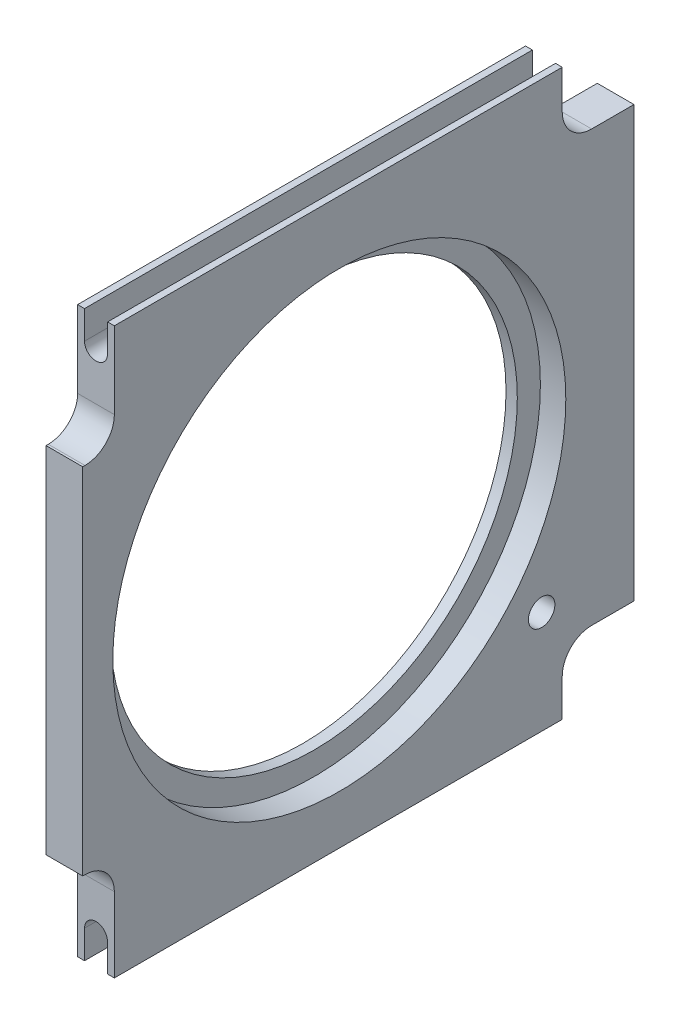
ISO-10303-21;
HEADER;
FILE_DESCRIPTION(('STEP AP214'),'2;1');
FILE_NAME('part.step','',(''),(''),'','','');
FILE_SCHEMA(('AUTOMOTIVE_DESIGN { 1 0 10303 214 1 1 1 1 }'));
ENDSEC;
DATA;
#1=APPLICATION_CONTEXT('core data for automotive mechanical design processes');
#2=APPLICATION_PROTOCOL_DEFINITION('international standard','automotive_design',2000,#1);
#3=PRODUCT_CONTEXT('',#1,'mechanical');
#4=PRODUCT('Part','Part','',(#3));
#5=PRODUCT_RELATED_PRODUCT_CATEGORY('part','',(#4));
#6=PRODUCT_DEFINITION_FORMATION('','',#4);
#7=PRODUCT_DEFINITION_CONTEXT('part definition',#1,'design');
#8=PRODUCT_DEFINITION('design','',#6,#7);
#9=PRODUCT_DEFINITION_SHAPE('','',#8);
#10=(LENGTH_UNIT() NAMED_UNIT(*) SI_UNIT(.MILLI.,.METRE.));
#11=(NAMED_UNIT(*) PLANE_ANGLE_UNIT() SI_UNIT($,.RADIAN.));
#12=(NAMED_UNIT(*) SI_UNIT($,.STERADIAN.) SOLID_ANGLE_UNIT());
#13=UNCERTAINTY_MEASURE_WITH_UNIT(LENGTH_MEASURE(1.E-05),#10,'distance_accuracy_value','');
#14=(GEOMETRIC_REPRESENTATION_CONTEXT(3) GLOBAL_UNCERTAINTY_ASSIGNED_CONTEXT((#13)) GLOBAL_UNIT_ASSIGNED_CONTEXT((#10,
#11,#12)) REPRESENTATION_CONTEXT('',''));
#15=CARTESIAN_POINT('',(0.,0.,0.));
#16=DIRECTION('',(0.,0.,1.));
#17=DIRECTION('',(1.,0.,0.));
#18=AXIS2_PLACEMENT_3D('',#15,#16,#17);
#19=CARTESIAN_POINT('',(8.255,-61.9477928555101,50.58201847));
#20=DIRECTION('',(0.,1.,0.));
#21=DIRECTION('',(0.,0.,1.));
#22=AXIS2_PLACEMENT_3D('',#19,#20,#21);
#23=PLANE('',#22);
#24=DIRECTION('',(0.,0.,-1.));
#25=VECTOR('',#24,1.);
#26=CARTESIAN_POINT('',(0.,-61.9477928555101,50.58201847));
#27=LINE('',#26,#25);
#28=CARTESIAN_POINT('',(0.,-61.9477928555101,50.58201847));
#29=VERTEX_POINT('',#28);
#30=CARTESIAN_POINT('',(0.,-61.9477928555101,-50.1230426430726));
#31=VERTEX_POINT('',#30);
#32=EDGE_CURVE('E364',#29,#31,#27,.T.);
#33=ORIENTED_EDGE('',*,*,#32,.T.);
#34=DIRECTION('',(1.,0.,0.));
#35=VECTOR('',#34,1.);
#36=CARTESIAN_POINT('',(8.255,-61.9477928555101,-50.1230426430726));
#37=LINE('',#36,#35);
#38=CARTESIAN_POINT('',(1.54781247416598,-61.9477928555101,-50.1230426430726));
#39=VERTEX_POINT('',#38);
#40=EDGE_CURVE('E248',#31,#39,#37,.T.);
#41=ORIENTED_EDGE('',*,*,#40,.T.);
#42=DIRECTION('',(0.,0.,1.));
#43=VECTOR('',#42,1.);
#44=CARTESIAN_POINT('',(1.54781247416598,-61.9477928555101,50.58201847));
#45=LINE('',#44,#43);
#46=CARTESIAN_POINT('',(1.54781247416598,-61.9477928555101,50.58201847));
#47=VERTEX_POINT('',#46);
#48=EDGE_CURVE('E297',#39,#47,#45,.T.);
#49=ORIENTED_EDGE('',*,*,#48,.T.);
#50=DIRECTION('',(-1.,0.,0.));
#51=VECTOR('',#50,1.);
#52=CARTESIAN_POINT('',(8.255,-61.9477928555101,50.58201847));
#53=LINE('',#52,#51);
#54=EDGE_CURVE('E387',#47,#29,#53,.T.);
#55=ORIENTED_EDGE('',*,*,#54,.T.);
#56=EDGE_LOOP('',(#33,#41,#49,#55));
#57=FACE_BOUND('',#56,.T.);
#58=ADVANCED_FACE('F32',(#57),#23,.F.);
#59=CARTESIAN_POINT('',(8.255,65.0522071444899,50.58201847));
#60=DIRECTION('',(0.,-1.,0.));
#61=DIRECTION('',(0.,0.,-1.));
#62=AXIS2_PLACEMENT_3D('',#59,#60,#61);
#63=PLANE('',#62);
#64=DIRECTION('',(0.,0.,1.));
#65=VECTOR('',#64,1.);
#66=CARTESIAN_POINT('',(8.255,65.0522071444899,50.58201847));
#67=LINE('',#66,#65);
#68=CARTESIAN_POINT('',(8.255,65.0522071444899,-50.1230426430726));
#69=VERTEX_POINT('',#68);
#70=CARTESIAN_POINT('',(8.255,65.0522071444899,50.58201847));
#71=VERTEX_POINT('',#70);
#72=EDGE_CURVE('E346',#69,#71,#67,.T.);
#73=ORIENTED_EDGE('',*,*,#72,.F.);
#74=DIRECTION('',(-1.,0.,0.));
#75=VECTOR('',#74,1.);
#76=CARTESIAN_POINT('',(8.255,65.0522071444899,-50.1230426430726));
#77=LINE('',#76,#75);
#78=CARTESIAN_POINT('',(6.74267838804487,65.0522071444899,-50.1230426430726));
#79=VERTEX_POINT('',#78);
#80=EDGE_CURVE('E282',#69,#79,#77,.T.);
#81=ORIENTED_EDGE('',*,*,#80,.T.);
#82=DIRECTION('',(0.,0.,1.));
#83=VECTOR('',#82,1.);
#84=CARTESIAN_POINT('',(6.74267838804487,65.0522071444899,50.58201847));
#85=LINE('',#84,#83);
#86=CARTESIAN_POINT('',(6.74267838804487,65.0522071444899,50.58201847));
#87=VERTEX_POINT('',#86);
#88=EDGE_CURVE('E314',#79,#87,#85,.T.);
#89=ORIENTED_EDGE('',*,*,#88,.T.);
#90=DIRECTION('',(-1.,0.,0.));
#91=VECTOR('',#90,1.);
#92=CARTESIAN_POINT('',(8.255,65.0522071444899,50.58201847));
#93=LINE('',#92,#91);
#94=EDGE_CURVE('E384',#71,#87,#93,.T.);
#95=ORIENTED_EDGE('',*,*,#94,.F.);
#96=EDGE_LOOP('',(#73,#81,#89,#95));
#97=FACE_BOUND('',#96,.T.);
#98=ADVANCED_FACE('F472',(#97),#63,.F.);
#99=CARTESIAN_POINT('',(8.255,0.,0.));
#100=DIRECTION('',(-1.,0.,0.));
#101=DIRECTION('',(0.,0.,1.));
#102=AXIS2_PLACEMENT_3D('',#99,#100,#101);
#103=CYLINDRICAL_SURFACE('',#102,45.7376354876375);
#104=CARTESIAN_POINT('',(0.,0.,0.));
#105=DIRECTION('',(1.,0.,0.));
#106=DIRECTION('',(0.,0.,-1.));
#107=AXIS2_PLACEMENT_3D('',#104,#105,#106);
#108=CIRCLE('',#107,45.7376354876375);
#109=CARTESIAN_POINT('',(0.,0.,-45.7376354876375));
#110=VERTEX_POINT('',#109);
#111=EDGE_CURVE('E323',#110,#110,#108,.T.);
#112=ORIENTED_EDGE('',*,*,#111,.F.);
#113=EDGE_LOOP('',(#112));
#114=FACE_BOUND('',#113,.T.);
#115=CARTESIAN_POINT('',(2.54,0.,0.));
#116=DIRECTION('',(1.,0.,0.));
#117=DIRECTION('',(0.,0.,-1.));
#118=AXIS2_PLACEMENT_3D('',#115,#116,#117);
#119=CIRCLE('',#118,45.7376354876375);
#120=CARTESIAN_POINT('',(2.54,0.,-45.7376354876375));
#121=VERTEX_POINT('',#120);
#122=EDGE_CURVE('E319',#121,#121,#119,.T.);
#123=ORIENTED_EDGE('',*,*,#122,.T.);
#124=EDGE_LOOP('',(#123));
#125=FACE_BOUND('',#124,.T.);
#126=ADVANCED_FACE('F479',(#114,#125),#103,.F.);
#127=CARTESIAN_POINT('',(8.255,-45.1325896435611,57.18601847));
#128=DIRECTION('',(-1.,0.,0.));
#129=DIRECTION('',(0.,0.,1.));
#130=AXIS2_PLACEMENT_3D('',#127,#128,#129);
#131=PLANE('',#130);
#132=CARTESIAN_POINT('',(8.255,0.,0.));
#133=DIRECTION('',(-1.,0.,0.));
#134=DIRECTION('',(0.,0.,1.));
#135=AXIS2_PLACEMENT_3D('',#132,#133,#134);
#136=CIRCLE('',#135,50.927);
#137=CARTESIAN_POINT('',(8.255,0.,50.927));
#138=VERTEX_POINT('',#137);
#139=EDGE_CURVE('E327',#138,#138,#136,.T.);
#140=ORIENTED_EDGE('',*,*,#139,.T.);
#141=EDGE_LOOP('',(#140));
#142=FACE_BOUND('',#141,.T.);
#143=DIRECTION('',(0.,0.,-1.));
#144=VECTOR('',#143,1.);
#145=CARTESIAN_POINT('',(8.255,-61.9477928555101,50.58201847));
#146=LINE('',#145,#144);
#147=CARTESIAN_POINT('',(8.255,-61.9477928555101,50.58201847));
#148=VERTEX_POINT('',#147);
#149=CARTESIAN_POINT('',(8.255,-61.9477928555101,-50.1230426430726));
#150=VERTEX_POINT('',#149);
#151=EDGE_CURVE('E341',#148,#150,#146,.T.);
#152=ORIENTED_EDGE('',*,*,#151,.T.);
#153=DIRECTION('',(0.,-1.,0.));
#154=VECTOR('',#153,1.);
#155=CARTESIAN_POINT('',(8.255,-53.5614383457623,-50.1230426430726));
#156=LINE('',#155,#154);
#157=CARTESIAN_POINT('',(8.255,-53.5614383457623,-50.1230426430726));
#158=VERTEX_POINT('',#157);
#159=EDGE_CURVE('E231',#158,#150,#156,.T.);
#160=ORIENTED_EDGE('',*,*,#159,.F.);
#161=CARTESIAN_POINT('',(8.255,-53.5614383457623,-56.7270426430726));
#162=DIRECTION('',(1.,0.,0.));
#163=DIRECTION('',(0.,0.,1.));
#164=AXIS2_PLACEMENT_3D('',#161,#162,#163);
#165=CIRCLE('',#164,6.604);
#166=CARTESIAN_POINT('',(8.255,-46.9574383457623,-56.7270426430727));
#167=VERTEX_POINT('',#166);
#168=EDGE_CURVE('E233',#167,#158,#165,.T.);
#169=ORIENTED_EDGE('',*,*,#168,.F.);
#170=DIRECTION('',(0.,0.,1.));
#171=VECTOR('',#170,1.);
#172=CARTESIAN_POINT('',(8.255,-46.9574383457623,-56.7270426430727));
#173=LINE('',#172,#171);
#174=CARTESIAN_POINT('',(8.255,-46.9574383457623,-66.25798153));
#175=VERTEX_POINT('',#174);
#176=EDGE_CURVE('E210',#175,#167,#173,.T.);
#177=ORIENTED_EDGE('',*,*,#176,.F.);
#178=DIRECTION('',(0.,1.,0.));
#179=VECTOR('',#178,1.);
#180=CARTESIAN_POINT('',(8.255,65.0522071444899,-66.25798153));
#181=LINE('',#180,#179);
#182=CARTESIAN_POINT('',(8.255,49.7211548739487,-66.25798153));
#183=VERTEX_POINT('',#182);
#184=EDGE_CURVE('E344',#175,#183,#181,.T.);
#185=ORIENTED_EDGE('',*,*,#184,.T.);
#186=DIRECTION('',(0.,0.,-1.));
#187=VECTOR('',#186,1.);
#188=CARTESIAN_POINT('',(8.255,49.7211548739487,-56.7270426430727));
#189=LINE('',#188,#187);
#190=CARTESIAN_POINT('',(8.255,49.7211548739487,-56.7270426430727));
#191=VERTEX_POINT('',#190);
#192=EDGE_CURVE('E256',#191,#183,#189,.T.);
#193=ORIENTED_EDGE('',*,*,#192,.F.);
#194=CARTESIAN_POINT('',(8.255,56.3251548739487,-56.7270426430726));
#195=DIRECTION('',(1.,0.,0.));
#196=DIRECTION('',(0.,0.,-1.));
#197=AXIS2_PLACEMENT_3D('',#194,#195,#196);
#198=CIRCLE('',#197,6.604);
#199=CARTESIAN_POINT('',(8.255,56.3251548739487,-50.1230426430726));
#200=VERTEX_POINT('',#199);
#201=EDGE_CURVE('E264',#200,#191,#198,.T.);
#202=ORIENTED_EDGE('',*,*,#201,.F.);
#203=DIRECTION('',(0.,-1.,0.));
#204=VECTOR('',#203,1.);
#205=CARTESIAN_POINT('',(8.255,71.5191522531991,-50.1230426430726));
#206=LINE('',#205,#204);
#207=EDGE_CURVE('E251',#69,#200,#206,.T.);
#208=ORIENTED_EDGE('',*,*,#207,.F.);
#209=ORIENTED_EDGE('',*,*,#72,.T.);
#210=DIRECTION('',(0.,-1.,0.));
#211=VECTOR('',#210,1.);
#212=CARTESIAN_POINT('',(8.255,65.0522071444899,50.58201847));
#213=LINE('',#212,#211);
#214=CARTESIAN_POINT('',(8.255,47.7611548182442,50.58201847));
#215=VERTEX_POINT('',#214);
#216=EDGE_CURVE('E348',#71,#215,#213,.T.);
#217=ORIENTED_EDGE('',*,*,#216,.T.);
#218=CARTESIAN_POINT('',(8.255,47.7611548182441,57.18601847));
#219=DIRECTION('',(-1.,0.,0.));
#220=DIRECTION('',(0.,0.,-1.));
#221=AXIS2_PLACEMENT_3D('',#218,#219,#220);
#222=CIRCLE('',#221,6.604);
#223=CARTESIAN_POINT('',(8.255,41.1571548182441,57.1860184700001));
#224=VERTEX_POINT('',#223);
#225=EDGE_CURVE('E350',#215,#224,#222,.T.);
#226=ORIENTED_EDGE('',*,*,#225,.T.);
#227=DIRECTION('',(0.,0.,1.));
#228=VECTOR('',#227,1.);
#229=CARTESIAN_POINT('',(8.255,41.1571548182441,57.1860184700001));
#230=LINE('',#229,#228);
#231=CARTESIAN_POINT('',(8.255,41.1571548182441,57.69401847));
#232=VERTEX_POINT('',#231);
#233=EDGE_CURVE('E352',#224,#232,#230,.T.);
#234=ORIENTED_EDGE('',*,*,#233,.T.);
#235=DIRECTION('',(0.,-1.,0.));
#236=VECTOR('',#235,1.);
#237=CARTESIAN_POINT('',(8.255,41.1571548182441,57.69401847));
#238=LINE('',#237,#236);
#239=CARTESIAN_POINT('',(8.255,-38.5285896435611,57.69401847));
#240=VERTEX_POINT('',#239);
#241=EDGE_CURVE('E331',#232,#240,#238,.T.);
#242=ORIENTED_EDGE('',*,*,#241,.T.);
#243=DIRECTION('',(0.,0.,-1.));
#244=VECTOR('',#243,1.);
#245=CARTESIAN_POINT('',(8.255,-38.5285896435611,57.69401847));
#246=LINE('',#245,#244);
#247=CARTESIAN_POINT('',(8.255,-38.5285896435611,57.18601847));
#248=VERTEX_POINT('',#247);
#249=EDGE_CURVE('E334',#240,#248,#246,.T.);
#250=ORIENTED_EDGE('',*,*,#249,.T.);
#251=CARTESIAN_POINT('',(8.255,-45.1325896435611,57.18601847));
#252=DIRECTION('',(-1.,0.,0.));
#253=DIRECTION('',(0.,0.,1.));
#254=AXIS2_PLACEMENT_3D('',#251,#252,#253);
#255=CIRCLE('',#254,6.60399999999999);
#256=CARTESIAN_POINT('',(8.255,-45.1325896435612,50.58201847));
#257=VERTEX_POINT('',#256);
#258=EDGE_CURVE('E337',#248,#257,#255,.T.);
#259=ORIENTED_EDGE('',*,*,#258,.T.);
#260=DIRECTION('',(0.,-1.,0.));
#261=VECTOR('',#260,1.);
#262=CARTESIAN_POINT('',(8.255,-45.1325896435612,50.58201847));
#263=LINE('',#262,#261);
#264=EDGE_CURVE('E339',#257,#148,#263,.T.);
#265=ORIENTED_EDGE('',*,*,#264,.T.);
#266=EDGE_LOOP('',(#152,#160,#169,#177,#185,#193,#202,#208,#209,#217,#226,#234,#242,#250,#259,#265));
#267=FACE_BOUND('',#266,.T.);
#268=CARTESIAN_POINT('',(8.255,-38.7619677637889,-45.4889270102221));
#269=DIRECTION('',(1.,0.,0.));
#270=DIRECTION('',(0.,0.,-1.));
#271=AXIS2_PLACEMENT_3D('',#268,#269,#270);
#272=CIRCLE('',#271,2.97643548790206);
#273=CARTESIAN_POINT('',(8.255,-38.7619677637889,-48.4653624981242));
#274=VERTEX_POINT('',#273);
#275=EDGE_CURVE('E320',#274,#274,#272,.T.);
#276=ORIENTED_EDGE('',*,*,#275,.F.);
#277=EDGE_LOOP('',(#276));
#278=FACE_BOUND('',#277,.T.);
#279=ADVANCED_FACE('F524',(#142,#267,#278),#131,.F.);
#280=CARTESIAN_POINT('',(0.,-45.1325896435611,57.18601847));
#281=DIRECTION('',(-1.,0.,0.));
#282=DIRECTION('',(0.,0.,1.));
#283=AXIS2_PLACEMENT_3D('',#280,#281,#282);
#284=PLANE('',#283);
#285=DIRECTION('',(0.,-1.,0.));
#286=VECTOR('',#285,1.);
#287=CARTESIAN_POINT('',(0.,-53.5614383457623,-50.1230426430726));
#288=LINE('',#287,#286);
#289=CARTESIAN_POINT('',(0.,-53.5614383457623,-50.1230426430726));
#290=VERTEX_POINT('',#289);
#291=EDGE_CURVE('E215',#290,#31,#288,.T.);
#292=ORIENTED_EDGE('',*,*,#291,.T.);
#293=ORIENTED_EDGE('',*,*,#32,.F.);
#294=DIRECTION('',(0.,-1.,0.));
#295=VECTOR('',#294,1.);
#296=CARTESIAN_POINT('',(0.,-45.1325896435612,50.58201847));
#297=LINE('',#296,#295);
#298=CARTESIAN_POINT('',(0.,-45.1325896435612,50.58201847));
#299=VERTEX_POINT('',#298);
#300=EDGE_CURVE('E361',#299,#29,#297,.T.);
#301=ORIENTED_EDGE('',*,*,#300,.F.);
#302=CARTESIAN_POINT('',(0.,-45.1325896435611,57.18601847));
#303=DIRECTION('',(-1.,0.,0.));
#304=DIRECTION('',(0.,0.,1.));
#305=AXIS2_PLACEMENT_3D('',#302,#303,#304);
#306=CIRCLE('',#305,6.60399999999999);
#307=CARTESIAN_POINT('',(0.,-38.5285896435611,57.18601847));
#308=VERTEX_POINT('',#307);
#309=EDGE_CURVE('E359',#308,#299,#306,.T.);
#310=ORIENTED_EDGE('',*,*,#309,.F.);
#311=DIRECTION('',(0.,0.,-1.));
#312=VECTOR('',#311,1.);
#313=CARTESIAN_POINT('',(0.,-38.5285896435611,57.69401847));
#314=LINE('',#313,#312);
#315=CARTESIAN_POINT('',(0.,-38.5285896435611,57.69401847));
#316=VERTEX_POINT('',#315);
#317=EDGE_CURVE('E357',#316,#308,#314,.T.);
#318=ORIENTED_EDGE('',*,*,#317,.F.);
#319=DIRECTION('',(0.,-1.,0.));
#320=VECTOR('',#319,1.);
#321=CARTESIAN_POINT('',(0.,41.1571548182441,57.69401847));
#322=LINE('',#321,#320);
#323=CARTESIAN_POINT('',(0.,41.1571548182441,57.69401847));
#324=VERTEX_POINT('',#323);
#325=EDGE_CURVE('E330',#324,#316,#322,.T.);
#326=ORIENTED_EDGE('',*,*,#325,.F.);
#327=DIRECTION('',(0.,0.,1.));
#328=VECTOR('',#327,1.);
#329=CARTESIAN_POINT('',(0.,41.1571548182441,57.1860184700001));
#330=LINE('',#329,#328);
#331=CARTESIAN_POINT('',(0.,41.1571548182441,57.1860184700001));
#332=VERTEX_POINT('',#331);
#333=EDGE_CURVE('E335',#332,#324,#330,.T.);
#334=ORIENTED_EDGE('',*,*,#333,.F.);
#335=CARTESIAN_POINT('',(0.,47.7611548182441,57.18601847));
#336=DIRECTION('',(-1.,0.,0.));
#337=DIRECTION('',(0.,0.,-1.));
#338=AXIS2_PLACEMENT_3D('',#335,#336,#337);
#339=CIRCLE('',#338,6.604);
#340=CARTESIAN_POINT('',(0.,47.7611548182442,50.58201847));
#341=VERTEX_POINT('',#340);
#342=EDGE_CURVE('E372',#341,#332,#339,.T.);
#343=ORIENTED_EDGE('',*,*,#342,.F.);
#344=DIRECTION('',(0.,-1.,0.));
#345=VECTOR('',#344,1.);
#346=CARTESIAN_POINT('',(0.,65.0522071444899,50.58201847));
#347=LINE('',#346,#345);
#348=CARTESIAN_POINT('',(0.,65.0522071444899,50.58201847));
#349=VERTEX_POINT('',#348);
#350=EDGE_CURVE('E370',#349,#341,#347,.T.);
#351=ORIENTED_EDGE('',*,*,#350,.F.);
#352=DIRECTION('',(0.,0.,1.));
#353=VECTOR('',#352,1.);
#354=CARTESIAN_POINT('',(0.,65.0522071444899,50.58201847));
#355=LINE('',#354,#353);
#356=CARTESIAN_POINT('',(0.,65.0522071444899,-50.1230426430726));
#357=VERTEX_POINT('',#356);
#358=EDGE_CURVE('E368',#357,#349,#355,.T.);
#359=ORIENTED_EDGE('',*,*,#358,.F.);
#360=DIRECTION('',(0.,-1.,0.));
#361=VECTOR('',#360,1.);
#362=CARTESIAN_POINT('',(0.,71.5191522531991,-50.1230426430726));
#363=LINE('',#362,#361);
#364=CARTESIAN_POINT('',(0.,56.3251548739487,-50.1230426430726));
#365=VERTEX_POINT('',#364);
#366=EDGE_CURVE('E252',#357,#365,#363,.T.);
#367=ORIENTED_EDGE('',*,*,#366,.T.);
#368=CARTESIAN_POINT('',(0.,56.3251548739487,-56.7270426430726));
#369=DIRECTION('',(1.,0.,0.));
#370=DIRECTION('',(0.,0.,-1.));
#371=AXIS2_PLACEMENT_3D('',#368,#369,#370);
#372=CIRCLE('',#371,6.604);
#373=CARTESIAN_POINT('',(0.,49.7211548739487,-56.7270426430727));
#374=VERTEX_POINT('',#373);
#375=EDGE_CURVE('E255',#365,#374,#372,.T.);
#376=ORIENTED_EDGE('',*,*,#375,.T.);
#377=DIRECTION('',(0.,0.,-1.));
#378=VECTOR('',#377,1.);
#379=CARTESIAN_POINT('',(0.,49.7211548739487,-56.7270426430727));
#380=LINE('',#379,#378);
#381=CARTESIAN_POINT('',(0.,49.7211548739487,-66.25798153));
#382=VERTEX_POINT('',#381);
#383=EDGE_CURVE('E259',#374,#382,#380,.T.);
#384=ORIENTED_EDGE('',*,*,#383,.T.);
#385=DIRECTION('',(0.,1.,0.));
#386=VECTOR('',#385,1.);
#387=CARTESIAN_POINT('',(0.,65.0522071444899,-66.25798153));
#388=LINE('',#387,#386);
#389=CARTESIAN_POINT('',(0.,-46.9574383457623,-66.25798153));
#390=VERTEX_POINT('',#389);
#391=EDGE_CURVE('E230',#390,#382,#388,.T.);
#392=ORIENTED_EDGE('',*,*,#391,.F.);
#393=DIRECTION('',(0.,0.,1.));
#394=VECTOR('',#393,1.);
#395=CARTESIAN_POINT('',(0.,-46.9574383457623,-56.7270426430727));
#396=LINE('',#395,#394);
#397=CARTESIAN_POINT('',(0.,-46.9574383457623,-56.7270426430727));
#398=VERTEX_POINT('',#397);
#399=EDGE_CURVE('E208',#390,#398,#396,.T.);
#400=ORIENTED_EDGE('',*,*,#399,.T.);
#401=CARTESIAN_POINT('',(0.,-53.5614383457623,-56.7270426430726));
#402=DIRECTION('',(1.,0.,0.));
#403=DIRECTION('',(0.,0.,1.));
#404=AXIS2_PLACEMENT_3D('',#401,#402,#403);
#405=CIRCLE('',#404,6.604);
#406=EDGE_CURVE('E218',#398,#290,#405,.T.);
#407=ORIENTED_EDGE('',*,*,#406,.T.);
#408=EDGE_LOOP('',(#292,#293,#301,#310,#318,#326,#334,#343,#351,#359,#367,#376,#384,#392,#400,#407));
#409=FACE_BOUND('',#408,.T.);
#410=ORIENTED_EDGE('',*,*,#111,.T.);
#411=EDGE_LOOP('',(#410));
#412=FACE_BOUND('',#411,.T.);
#413=CARTESIAN_POINT('',(0.,-38.7619677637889,-45.4889270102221));
#414=DIRECTION('',(1.,0.,0.));
#415=DIRECTION('',(0.,0.,-1.));
#416=AXIS2_PLACEMENT_3D('',#413,#414,#415);
#417=CIRCLE('',#416,2.97643548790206);
#418=CARTESIAN_POINT('',(0.,-38.7619677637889,-48.4653624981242));
#419=VERTEX_POINT('',#418);
#420=EDGE_CURVE('E324',#419,#419,#417,.T.);
#421=ORIENTED_EDGE('',*,*,#420,.T.);
#422=EDGE_LOOP('',(#421));
#423=FACE_BOUND('',#422,.T.);
#424=ADVANCED_FACE('F227',(#409,#412,#423),#284,.T.);
#425=CARTESIAN_POINT('',(8.255,41.1571548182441,57.69401847));
#426=DIRECTION('',(0.,0.,-1.));
#427=DIRECTION('',(-1.,0.,0.));
#428=AXIS2_PLACEMENT_3D('',#425,#426,#427);
#429=PLANE('',#428);
#430=ORIENTED_EDGE('',*,*,#325,.T.);
#431=DIRECTION('',(-1.,0.,0.));
#432=VECTOR('',#431,1.);
#433=CARTESIAN_POINT('',(8.255,-38.5285896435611,57.69401847));
#434=LINE('',#433,#432);
#435=EDGE_CURVE('E397',#240,#316,#434,.T.);
#436=ORIENTED_EDGE('',*,*,#435,.F.);
#437=ORIENTED_EDGE('',*,*,#241,.F.);
#438=DIRECTION('',(-1.,0.,0.));
#439=VECTOR('',#438,1.);
#440=CARTESIAN_POINT('',(8.255,41.1571548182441,57.69401847));
#441=LINE('',#440,#439);
#442=EDGE_CURVE('E354',#232,#324,#441,.T.);
#443=ORIENTED_EDGE('',*,*,#442,.T.);
#444=EDGE_LOOP('',(#430,#436,#437,#443));
#445=FACE_BOUND('',#444,.T.);
#446=ADVANCED_FACE('F34',(#445),#429,.F.);
#447=CARTESIAN_POINT('',(8.255,-38.5285896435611,57.69401847));
#448=DIRECTION('',(0.,1.,0.));
#449=DIRECTION('',(0.,0.,1.));
#450=AXIS2_PLACEMENT_3D('',#447,#448,#449);
#451=PLANE('',#450);
#452=ORIENTED_EDGE('',*,*,#317,.T.);
#453=DIRECTION('',(-1.,0.,0.));
#454=VECTOR('',#453,1.);
#455=CARTESIAN_POINT('',(8.255,-38.5285896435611,57.18601847));
#456=LINE('',#455,#454);
#457=EDGE_CURVE('E394',#248,#308,#456,.T.);
#458=ORIENTED_EDGE('',*,*,#457,.F.);
#459=ORIENTED_EDGE('',*,*,#249,.F.);
#460=ORIENTED_EDGE('',*,*,#435,.T.);
#461=EDGE_LOOP('',(#452,#458,#459,#460));
#462=FACE_BOUND('',#461,.T.);
#463=ADVANCED_FACE('F534',(#462),#451,.F.);
#464=CARTESIAN_POINT('',(8.255,-45.1325896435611,57.18601847));
#465=DIRECTION('',(-1.,0.,0.));
#466=DIRECTION('',(0.,0.,1.));
#467=AXIS2_PLACEMENT_3D('',#464,#465,#466);
#468=CYLINDRICAL_SURFACE('',#467,6.60399999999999);
#469=ORIENTED_EDGE('',*,*,#309,.T.);
#470=DIRECTION('',(-1.,0.,0.));
#471=VECTOR('',#470,1.);
#472=CARTESIAN_POINT('',(8.255,-45.1325896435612,50.58201847));
#473=LINE('',#472,#471);
#474=EDGE_CURVE('E391',#257,#299,#473,.T.);
#475=ORIENTED_EDGE('',*,*,#474,.F.);
#476=ORIENTED_EDGE('',*,*,#258,.F.);
#477=ORIENTED_EDGE('',*,*,#457,.T.);
#478=EDGE_LOOP('',(#469,#475,#476,#477));
#479=FACE_BOUND('',#478,.T.);
#480=ADVANCED_FACE('F494',(#479),#468,.F.);
#481=CARTESIAN_POINT('',(8.255,-45.1325896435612,50.58201847));
#482=DIRECTION('',(0.,0.,-1.));
#483=DIRECTION('',(-1.,0.,0.));
#484=AXIS2_PLACEMENT_3D('',#481,#482,#483);
#485=PLANE('',#484);
#486=ORIENTED_EDGE('',*,*,#54,.F.);
#487=DIRECTION('',(0.,1.,0.));
#488=VECTOR('',#487,1.);
#489=CARTESIAN_POINT('',(1.54781247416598,-45.1325896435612,50.58201847));
#490=LINE('',#489,#488);
#491=CARTESIAN_POINT('',(1.54781247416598,-55.5977928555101,50.58201847));
#492=VERTEX_POINT('',#491);
#493=EDGE_CURVE('E299',#47,#492,#490,.T.);
#494=ORIENTED_EDGE('',*,*,#493,.T.);
#495=CARTESIAN_POINT('',(4.12749997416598,-55.5977928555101,50.58201847));
#496=DIRECTION('',(0.,0.,-1.));
#497=DIRECTION('',(-1.,0.,0.));
#498=AXIS2_PLACEMENT_3D('',#495,#496,#497);
#499=CIRCLE('',#498,2.5796875);
#500=CARTESIAN_POINT('',(6.70718747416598,-55.5977928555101,50.58201847));
#501=VERTEX_POINT('',#500);
#502=EDGE_CURVE('E302',#492,#501,#499,.T.);
#503=ORIENTED_EDGE('',*,*,#502,.T.);
#504=DIRECTION('',(0.,-1.,0.));
#505=VECTOR('',#504,1.);
#506=CARTESIAN_POINT('',(6.70718747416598,-45.1325896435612,50.58201847));
#507=LINE('',#506,#505);
#508=CARTESIAN_POINT('',(6.70718747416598,-61.9477928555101,50.58201847));
#509=VERTEX_POINT('',#508);
#510=EDGE_CURVE('E294',#501,#509,#507,.T.);
#511=ORIENTED_EDGE('',*,*,#510,.T.);
#512=EDGE_CURVE('E388',#148,#509,#53,.T.);
#513=ORIENTED_EDGE('',*,*,#512,.F.);
#514=ORIENTED_EDGE('',*,*,#264,.F.);
#515=ORIENTED_EDGE('',*,*,#474,.T.);
#516=ORIENTED_EDGE('',*,*,#300,.T.);
#517=EDGE_LOOP('',(#486,#494,#503,#511,#513,#514,#515,#516));
#518=FACE_BOUND('',#517,.T.);
#519=ADVANCED_FACE('F487',(#518),#485,.F.);
#520=DIRECTION('',(0.,0.,-1.));
#521=VECTOR('',#520,1.);
#522=CARTESIAN_POINT('',(6.70718747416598,-61.9477928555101,50.58201847));
#523=LINE('',#522,#521);
#524=CARTESIAN_POINT('',(6.70718747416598,-61.9477928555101,-50.1230426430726));
#525=VERTEX_POINT('',#524);
#526=EDGE_CURVE('E289',#509,#525,#523,.T.);
#527=ORIENTED_EDGE('',*,*,#526,.T.);
#528=DIRECTION('',(1.,0.,0.));
#529=VECTOR('',#528,1.);
#530=CARTESIAN_POINT('',(8.255,-61.9477928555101,-50.1230426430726));
#531=LINE('',#530,#529);
#532=EDGE_CURVE('E47',#525,#150,#531,.T.);
#533=ORIENTED_EDGE('',*,*,#532,.T.);
#534=ORIENTED_EDGE('',*,*,#151,.F.);
#535=ORIENTED_EDGE('',*,*,#512,.T.);
#536=EDGE_LOOP('',(#527,#533,#534,#535));
#537=FACE_BOUND('',#536,.T.);
#538=ADVANCED_FACE('F475',(#537),#23,.F.);
#539=CARTESIAN_POINT('',(8.255,65.0522071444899,-66.25798153));
#540=DIRECTION('',(0.,0.,1.));
#541=DIRECTION('',(0.,-1.,0.));
#542=AXIS2_PLACEMENT_3D('',#539,#540,#541);
#543=PLANE('',#542);
#544=ORIENTED_EDGE('',*,*,#184,.F.);
#545=DIRECTION('',(-1.,0.,0.));
#546=VECTOR('',#545,1.);
#547=CARTESIAN_POINT('',(8.255,-46.9574383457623,-66.25798153));
#548=LINE('',#547,#546);
#549=EDGE_CURVE('E11',#175,#390,#548,.T.);
#550=ORIENTED_EDGE('',*,*,#549,.T.);
#551=ORIENTED_EDGE('',*,*,#391,.T.);
#552=DIRECTION('',(1.,0.,0.));
#553=VECTOR('',#552,1.);
#554=CARTESIAN_POINT('',(8.255,49.7211548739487,-66.25798153));
#555=LINE('',#554,#553);
#556=EDGE_CURVE('E423',#382,#183,#555,.T.);
#557=ORIENTED_EDGE('',*,*,#556,.T.);
#558=EDGE_LOOP('',(#544,#550,#551,#557));
#559=FACE_BOUND('',#558,.T.);
#560=ADVANCED_FACE('F486',(#559),#543,.F.);
#561=DIRECTION('',(0.,0.,-1.));
#562=VECTOR('',#561,1.);
#563=CARTESIAN_POINT('',(1.54781247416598,65.0522071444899,50.58201847));
#564=LINE('',#563,#562);
#565=CARTESIAN_POINT('',(1.54781247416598,65.0522071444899,50.58201847));
#566=VERTEX_POINT('',#565);
#567=CARTESIAN_POINT('',(1.54781247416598,65.0522071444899,-50.1230426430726));
#568=VERTEX_POINT('',#567);
#569=EDGE_CURVE('E309',#566,#568,#564,.T.);
#570=ORIENTED_EDGE('',*,*,#569,.T.);
#571=DIRECTION('',(-1.,0.,0.));
#572=VECTOR('',#571,1.);
#573=CARTESIAN_POINT('',(8.255,65.0522071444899,-50.1230426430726));
#574=LINE('',#573,#572);
#575=EDGE_CURVE('E55',#568,#357,#574,.T.);
#576=ORIENTED_EDGE('',*,*,#575,.T.);
#577=ORIENTED_EDGE('',*,*,#358,.T.);
#578=EDGE_CURVE('E383',#566,#349,#93,.T.);
#579=ORIENTED_EDGE('',*,*,#578,.F.);
#580=EDGE_LOOP('',(#570,#576,#577,#579));
#581=FACE_BOUND('',#580,.T.);
#582=ADVANCED_FACE('F482',(#581),#63,.F.);
#583=CARTESIAN_POINT('',(8.255,65.0522071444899,50.58201847));
#584=DIRECTION('',(0.,0.,-1.));
#585=DIRECTION('',(-1.,0.,0.));
#586=AXIS2_PLACEMENT_3D('',#583,#584,#585);
#587=PLANE('',#586);
#588=ORIENTED_EDGE('',*,*,#94,.T.);
#589=DIRECTION('',(-0.00563396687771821,-0.999984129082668,0.));
#590=VECTOR('',#589,1.);
#591=CARTESIAN_POINT('',(6.74272639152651,65.060727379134,50.58201847));
#592=LINE('',#591,#590);
#593=CARTESIAN_POINT('',(6.70705140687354,58.728702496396,50.58201847));
#594=VERTEX_POINT('',#593);
#595=EDGE_CURVE('E410',#87,#594,#592,.T.);
#596=ORIENTED_EDGE('',*,*,#595,.T.);
#597=CARTESIAN_POINT('',(4.12749997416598,58.7022071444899,50.58201847));
#598=DIRECTION('',(0.,0.,-1.));
#599=DIRECTION('',(-1.,0.,0.));
#600=AXIS2_PLACEMENT_3D('',#597,#598,#599);
#601=CIRCLE('',#600,2.5796875);
#602=CARTESIAN_POINT('',(1.54781247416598,58.7022071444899,50.58201847));
#603=VERTEX_POINT('',#602);
#604=EDGE_CURVE('E407',#594,#603,#601,.T.);
#605=ORIENTED_EDGE('',*,*,#604,.T.);
#606=DIRECTION('',(0.,1.,0.));
#607=VECTOR('',#606,1.);
#608=CARTESIAN_POINT('',(1.54781247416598,65.0522071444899,50.58201847));
#609=LINE('',#608,#607);
#610=EDGE_CURVE('E400',#603,#566,#609,.T.);
#611=ORIENTED_EDGE('',*,*,#610,.T.);
#612=ORIENTED_EDGE('',*,*,#578,.T.);
#613=ORIENTED_EDGE('',*,*,#350,.T.);
#614=DIRECTION('',(-1.,0.,0.));
#615=VECTOR('',#614,1.);
#616=CARTESIAN_POINT('',(8.255,47.7611548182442,50.58201847));
#617=LINE('',#616,#615);
#618=EDGE_CURVE('E380',#215,#341,#617,.T.);
#619=ORIENTED_EDGE('',*,*,#618,.F.);
#620=ORIENTED_EDGE('',*,*,#216,.F.);
#621=EDGE_LOOP('',(#588,#596,#605,#611,#612,#613,#619,#620));
#622=FACE_BOUND('',#621,.T.);
#623=ADVANCED_FACE('F550',(#622),#587,.F.);
#624=CARTESIAN_POINT('',(8.255,47.7611548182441,57.18601847));
#625=DIRECTION('',(-1.,0.,0.));
#626=DIRECTION('',(0.,0.,1.));
#627=AXIS2_PLACEMENT_3D('',#624,#625,#626);
#628=CYLINDRICAL_SURFACE('',#627,6.604);
#629=ORIENTED_EDGE('',*,*,#342,.T.);
#630=DIRECTION('',(-1.,0.,0.));
#631=VECTOR('',#630,1.);
#632=CARTESIAN_POINT('',(8.255,41.1571548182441,57.1860184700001));
#633=LINE('',#632,#631);
#634=EDGE_CURVE('E377',#224,#332,#633,.T.);
#635=ORIENTED_EDGE('',*,*,#634,.F.);
#636=ORIENTED_EDGE('',*,*,#225,.F.);
#637=ORIENTED_EDGE('',*,*,#618,.T.);
#638=EDGE_LOOP('',(#629,#635,#636,#637));
#639=FACE_BOUND('',#638,.T.);
#640=ADVANCED_FACE('F545',(#639),#628,.F.);
#641=CARTESIAN_POINT('',(8.255,41.1571548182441,57.1860184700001));
#642=DIRECTION('',(0.,-1.,0.));
#643=DIRECTION('',(0.,0.,-1.));
#644=AXIS2_PLACEMENT_3D('',#641,#642,#643);
#645=PLANE('',#644);
#646=ORIENTED_EDGE('',*,*,#333,.T.);
#647=ORIENTED_EDGE('',*,*,#442,.F.);
#648=ORIENTED_EDGE('',*,*,#233,.F.);
#649=ORIENTED_EDGE('',*,*,#634,.T.);
#650=EDGE_LOOP('',(#646,#647,#648,#649));
#651=FACE_BOUND('',#650,.T.);
#652=ADVANCED_FACE('F540',(#651),#645,.F.);
#653=CARTESIAN_POINT('',(8.255,-38.7619677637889,-45.4889270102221));
#654=DIRECTION('',(-1.,0.,0.));
#655=DIRECTION('',(0.,0.,1.));
#656=AXIS2_PLACEMENT_3D('',#653,#654,#655);
#657=CYLINDRICAL_SURFACE('',#656,2.97643548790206);
#658=ORIENTED_EDGE('',*,*,#275,.T.);
#659=EDGE_LOOP('',(#658));
#660=FACE_BOUND('',#659,.T.);
#661=ORIENTED_EDGE('',*,*,#420,.F.);
#662=EDGE_LOOP('',(#661));
#663=FACE_BOUND('',#662,.T.);
#664=ADVANCED_FACE('F578',(#660,#663),#657,.F.);
#665=CARTESIAN_POINT('',(2.54,0.,0.));
#666=DIRECTION('',(1.,0.,0.));
#667=DIRECTION('',(0.,0.,-1.));
#668=AXIS2_PLACEMENT_3D('',#665,#666,#667);
#669=CYLINDRICAL_SURFACE('',#668,50.927);
#670=CARTESIAN_POINT('',(2.54,0.,0.));
#671=DIRECTION('',(1.,0.,0.));
#672=DIRECTION('',(0.,0.,-1.));
#673=AXIS2_PLACEMENT_3D('',#670,#671,#672);
#674=CIRCLE('',#673,50.927);
#675=CARTESIAN_POINT('',(2.54,0.,-50.927));
#676=VERTEX_POINT('',#675);
#677=EDGE_CURVE('E316',#676,#676,#674,.T.);
#678=ORIENTED_EDGE('',*,*,#677,.F.);
#679=EDGE_LOOP('',(#678));
#680=FACE_BOUND('',#679,.T.);
#681=ORIENTED_EDGE('',*,*,#139,.F.);
#682=EDGE_LOOP('',(#681));
#683=FACE_BOUND('',#682,.T.);
#684=ADVANCED_FACE('F573',(#680,#683),#669,.F.);
#685=CARTESIAN_POINT('',(2.54,0.,0.));
#686=DIRECTION('',(1.,0.,0.));
#687=DIRECTION('',(0.,0.,-1.));
#688=AXIS2_PLACEMENT_3D('',#685,#686,#687);
#689=PLANE('',#688);
#690=ORIENTED_EDGE('',*,*,#122,.F.);
#691=EDGE_LOOP('',(#690));
#692=FACE_BOUND('',#691,.T.);
#693=ORIENTED_EDGE('',*,*,#677,.T.);
#694=EDGE_LOOP('',(#693));
#695=FACE_BOUND('',#694,.T.);
#696=ADVANCED_FACE('F569',(#692,#695),#689,.T.);
#697=CARTESIAN_POINT('',(4.12749997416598,58.7022071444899,57.69401847));
#698=DIRECTION('',(0.,0.,-1.));
#699=DIRECTION('',(0.,1.,0.));
#700=AXIS2_PLACEMENT_3D('',#697,#698,#699);
#701=CYLINDRICAL_SURFACE('',#700,2.5796875);
#702=CARTESIAN_POINT('',(4.12749997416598,61.2818946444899,-52.3631513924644));
#703=CARTESIAN_POINT('',(4.1855298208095,61.2818941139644,-52.3631505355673));
#704=CARTESIAN_POINT('',(4.24356761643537,61.2799299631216,-52.3609162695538));
#705=CARTESIAN_POINT('',(4.35906116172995,61.2721347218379,-52.352087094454));
#706=CARTESIAN_POINT('',(4.4165165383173,61.2663012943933,-52.3454895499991));
#707=CARTESIAN_POINT('',(4.58740123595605,61.243163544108,-52.3194837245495));
#708=CARTESIAN_POINT('',(4.69919565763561,61.2202223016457,-52.2938632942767));
#709=CARTESIAN_POINT('',(4.91379303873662,61.1616428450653,-52.2300431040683));
#710=CARTESIAN_POINT('',(5.01668711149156,61.1261588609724,-52.1919965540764));
#711=CARTESIAN_POINT('',(5.21402571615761,61.0443554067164,-52.1069278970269));
#712=CARTESIAN_POINT('',(5.30846623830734,60.9980308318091,-52.0599015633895));
#713=CARTESIAN_POINT('',(5.53780221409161,60.8681866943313,-51.9326954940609));
#714=CARTESIAN_POINT('',(5.6667287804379,60.7781481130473,-51.8484051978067));
#715=CARTESIAN_POINT('',(5.90418058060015,60.5789735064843,-51.6737773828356));
#716=CARTESIAN_POINT('',(6.01266902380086,60.4698037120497,-51.5834293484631));
#717=CARTESIAN_POINT('',(6.21052664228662,60.2319704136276,-51.4004508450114));
#718=CARTESIAN_POINT('',(6.29947404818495,60.1029632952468,-51.3078106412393));
#719=CARTESIAN_POINT('',(6.4535444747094,59.828698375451,-51.1266023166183));
#720=CARTESIAN_POINT('',(6.5186746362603,59.6834454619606,-51.0380329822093));
#721=CARTESIAN_POINT('',(6.59740168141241,59.4515394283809,-50.9092300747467));
#722=CARTESIAN_POINT('',(6.6207892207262,59.3697675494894,-50.8659949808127));
#723=CARTESIAN_POINT('',(6.65956259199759,59.2029741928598,-50.7823263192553));
#724=CARTESIAN_POINT('',(6.67495263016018,59.1179544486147,-50.741891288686));
#725=CARTESIAN_POINT('',(6.69717321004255,58.9453778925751,-50.6643539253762));
#726=CARTESIAN_POINT('',(6.70400951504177,58.8578228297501,-50.6272493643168));
#727=CARTESIAN_POINT('',(6.70861488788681,58.6809803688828,-50.5567953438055));
#728=CARTESIAN_POINT('',(6.70638616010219,58.591693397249,-50.5234449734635));
#729=CARTESIAN_POINT('',(6.69347348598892,58.4257496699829,-50.4655046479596));
#730=CARTESIAN_POINT('',(6.68409474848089,58.3491870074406,-50.4403492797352));
#731=CARTESIAN_POINT('',(6.65828029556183,58.196294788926,-50.3931615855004));
#732=CARTESIAN_POINT('',(6.64184579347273,58.1199651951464,-50.3711287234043));
#733=CARTESIAN_POINT('',(6.60185025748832,57.9683709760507,-50.3302612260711));
#734=CARTESIAN_POINT('',(6.57829386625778,57.8931056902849,-50.3114245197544));
#735=CARTESIAN_POINT('',(6.52411306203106,57.7444481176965,-50.2769063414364));
#736=CARTESIAN_POINT('',(6.49348932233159,57.671055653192,-50.2612245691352));
#737=CARTESIAN_POINT('',(6.39973579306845,57.4729309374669,-50.2222861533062));
#738=CARTESIAN_POINT('',(6.32943082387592,57.350882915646,-50.2021437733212));
#739=CARTESIAN_POINT('',(6.16930550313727,57.1192764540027,-50.1699152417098));
#740=CARTESIAN_POINT('',(6.07948736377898,57.0097166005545,-50.157828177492));
#741=CARTESIAN_POINT('',(5.88471909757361,56.8084817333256,-50.1399923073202));
#742=CARTESIAN_POINT('',(5.78009118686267,56.7165047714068,-50.134126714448));
#743=CARTESIAN_POINT('',(5.55731280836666,56.550526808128,-50.1263647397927));
#744=CARTESIAN_POINT('',(5.43916085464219,56.4765277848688,-50.1244687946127));
#745=CARTESIAN_POINT('',(5.18904392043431,56.3467224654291,-50.122748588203));
#746=CARTESIAN_POINT('',(5.05678639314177,56.2914786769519,-50.1229833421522));
#747=CARTESIAN_POINT('',(4.78495772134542,56.203618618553,-50.1240139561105));
#748=CARTESIAN_POINT('',(4.64538606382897,56.1710039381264,-50.1248098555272));
#749=CARTESIAN_POINT('',(4.36067389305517,56.1289942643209,-50.1259218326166));
#750=CARTESIAN_POINT('',(4.21548159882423,56.1199489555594,-50.1262306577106));
#751=CARTESIAN_POINT('',(3.92563697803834,56.1263473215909,-50.1260351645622));
#752=CARTESIAN_POINT('',(3.78098466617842,56.1417916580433,-50.1255308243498));
#753=CARTESIAN_POINT('',(3.49627951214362,56.1967383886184,-50.1242348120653));
#754=CARTESIAN_POINT('',(3.35622808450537,56.2362481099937,-50.1234430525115));
#755=CARTESIAN_POINT('',(3.08472990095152,56.3382177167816,-50.122859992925));
#756=CARTESIAN_POINT('',(2.95328363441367,56.4006789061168,-50.1230687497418));
#757=CARTESIAN_POINT('',(2.70280632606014,56.5467389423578,-50.1263586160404));
#758=CARTESIAN_POINT('',(2.58377042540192,56.6303294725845,-50.1294385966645));
#759=CARTESIAN_POINT('',(2.36154761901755,56.8161616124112,-50.140665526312));
#760=CARTESIAN_POINT('',(2.25835815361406,56.9184002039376,-50.1488116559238));
#761=CARTESIAN_POINT('',(2.07249312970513,57.1363553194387,-50.172155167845));
#762=CARTESIAN_POINT('',(1.98949616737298,57.251810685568,-50.1872292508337));
#763=CARTESIAN_POINT('',(1.84406113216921,57.4936573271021,-50.2260901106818));
#764=CARTESIAN_POINT('',(1.78161740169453,57.6200455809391,-50.2498744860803));
#765=CARTESIAN_POINT('',(1.67996083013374,57.875895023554,-50.306394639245));
#766=CARTESIAN_POINT('',(1.64017644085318,58.0051861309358,-50.3388766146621));
#767=CARTESIAN_POINT('',(1.58148902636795,58.2657845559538,-50.4131585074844));
#768=CARTESIAN_POINT('',(1.56258807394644,58.3970920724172,-50.4549593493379));
#769=CARTESIAN_POINT('',(1.54467547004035,58.6609556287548,-50.5482978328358));
#770=CARTESIAN_POINT('',(1.54613251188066,58.793470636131,-50.6000377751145));
#771=CARTESIAN_POINT('',(1.56850380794,59.0534503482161,-50.7112926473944));
#772=CARTESIAN_POINT('',(1.58942424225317,59.1809134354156,-50.7708100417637));
#773=CARTESIAN_POINT('',(1.65206688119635,59.4417234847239,-50.9026644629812));
#774=CARTESIAN_POINT('',(1.69577549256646,59.5742405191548,-50.97569177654));
#775=CARTESIAN_POINT('',(1.80245084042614,59.8282366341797,-51.1267636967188));
#776=CARTESIAN_POINT('',(1.86543397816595,59.9497061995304,-51.2048125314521));
#777=CARTESIAN_POINT('',(2.01992901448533,60.1980398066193,-51.3754430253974));
#778=CARTESIAN_POINT('',(2.11434525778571,60.3228375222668,-51.4684068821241));
#779=CARTESIAN_POINT('',(2.32489825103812,60.5542059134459,-51.6526189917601));
#780=CARTESIAN_POINT('',(2.44103873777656,60.6607734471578,-51.743866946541));
#781=CARTESIAN_POINT('',(2.66762018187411,60.832753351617,-51.8995341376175));
#782=CARTESIAN_POINT('',(2.77399798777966,60.9020961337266,-51.9655258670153));
#783=CARTESIAN_POINT('',(3.00009341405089,61.0260603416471,-52.087877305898));
#784=CARTESIAN_POINT('',(3.11978731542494,61.0807073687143,-52.1442537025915));
#785=CARTESIAN_POINT('',(3.33976887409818,61.1607189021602,-52.228971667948));
#786=CARTESIAN_POINT('',(3.43727843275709,61.1899950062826,-52.2607971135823));
#787=CARTESIAN_POINT('',(3.63795031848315,61.2370969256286,-52.3126466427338));
#788=CARTESIAN_POINT('',(3.74109600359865,61.2549546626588,-52.332703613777));
#789=CARTESIAN_POINT('',(3.8922652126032,61.2715770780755,-52.3514544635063));
#790=CARTESIAN_POINT('',(3.93910524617,61.2754377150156,-52.3558267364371));
#791=CARTESIAN_POINT('',(4.03312836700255,61.280597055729,-52.3616759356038));
#792=CARTESIAN_POINT('',(4.0803115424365,61.2818950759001,-52.3631520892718));
#793=CARTESIAN_POINT('',(4.12749997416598,61.2818946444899,-52.3631513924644));
#794=B_SPLINE_CURVE_WITH_KNOTS('',3,(#702,#703,#704,#705,#706,#707,#708,#709,#710,#711,#712,
#713,#714,#715,#716,#717,#718,#719,#720,#721,#722,#723,#724,#725,#726,#727,#728,#729,#730,#731,
#732,#733,#734,#735,#736,#737,#738,#739,#740,#741,#742,#743,#744,#745,#746,#747,#748,#749,#750,
#751,#752,#753,#754,#755,#756,#757,#758,#759,#760,#761,#762,#763,#764,#765,#766,#767,#768,#769,
#770,#771,#772,#773,#774,#775,#776,#777,#778,#779,#780,#781,#782,#783,#784,#785,#786,#787,#788,
#789,#790,#791,#792,#793),.UNSPECIFIED.,.T.,.F.,(4,2,2,2,2,2,2,2,2,2,2,2,2,2,2,2,2,2,2,2,2,2,2,
2,2,2,2,2,2,2,2,2,2,2,2,2,2,2,2,2,2,2,2,2,2,4),(0.,0.174022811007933,0.348150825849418,
0.696859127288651,1.04142076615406,1.38614498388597,1.91855412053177,2.45191267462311,
2.99584712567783,3.53961835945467,3.82548606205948,4.11120326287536,4.39672785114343,
4.68218301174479,4.92523366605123,5.16824254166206,5.41109334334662,5.65392101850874,
6.07847934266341,6.50298956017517,6.91938183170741,7.33581989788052,7.7638267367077,
8.1918636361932,8.62621582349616,9.06057974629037,9.4950759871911,9.92959691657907,
10.3639470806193,10.7982270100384,11.2250605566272,11.6517765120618,12.0671891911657,
12.482643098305,12.9076772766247,13.3328464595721,13.8035122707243,14.274579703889,
14.8184309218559,15.3623757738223,15.7903613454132,16.2175964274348,16.5364675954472,
16.8544433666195,16.9959166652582,17.1374276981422),.UNSPECIFIED.);
#795=CARTESIAN_POINT('',(5.12970259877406,56.3251548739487,-50.1230426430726));
#796=VERTEX_POINT('',#795);
#797=CARTESIAN_POINT('',(3.12529734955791,56.3251548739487,-50.1230426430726));
#798=VERTEX_POINT('',#797);
#799=EDGE_CURVE('E415',#796,#798,#794,.T.);
#800=ORIENTED_EDGE('',*,*,#799,.T.);
#801=CARTESIAN_POINT('',(4.12749997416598,58.7022071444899,-50.1230426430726));
#802=DIRECTION('',(0.,0.,1.));
#803=DIRECTION('',(1.,0.,0.));
#804=AXIS2_PLACEMENT_3D('',#801,#802,#803);
#805=CIRCLE('',#804,2.5796875);
#806=CARTESIAN_POINT('',(1.54781247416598,58.7022071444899,-50.1230426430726));
#807=VERTEX_POINT('',#806);
#808=EDGE_CURVE('E271',#798,#807,#805,.F.);
#809=ORIENTED_EDGE('',*,*,#808,.T.);
#810=DIRECTION('',(0.,0.,-1.));
#811=VECTOR('',#810,1.);
#812=CARTESIAN_POINT('',(1.54781247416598,58.7022071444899,57.69401847));
#813=LINE('',#812,#811);
#814=EDGE_CURVE('E305',#603,#807,#813,.T.);
#815=ORIENTED_EDGE('',*,*,#814,.F.);
#816=ORIENTED_EDGE('',*,*,#604,.F.);
#817=DIRECTION('',(0.,0.,-1.));
#818=VECTOR('',#817,1.);
#819=CARTESIAN_POINT('',(6.70705140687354,58.728702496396,57.69401847));
#820=LINE('',#819,#818);
#821=CARTESIAN_POINT('',(6.70705140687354,58.728702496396,-50.1230426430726));
#822=VERTEX_POINT('',#821);
#823=EDGE_CURVE('E306',#594,#822,#820,.T.);
#824=ORIENTED_EDGE('',*,*,#823,.T.);
#825=EDGE_CURVE('E277',#822,#796,#805,.F.);
#826=ORIENTED_EDGE('',*,*,#825,.T.);
#827=EDGE_LOOP('',(#800,#809,#815,#816,#824,#826));
#828=FACE_BOUND('',#827,.T.);
#829=ADVANCED_FACE('F425',(#828),#701,.F.);
#830=CARTESIAN_POINT('',(6.76268773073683,68.6037056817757,57.69401847));
#831=DIRECTION('',(0.999984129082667,-0.00563396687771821,0.));
#832=DIRECTION('',(0.00563396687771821,0.999984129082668,0.));
#833=AXIS2_PLACEMENT_3D('',#830,#831,#832);
#834=PLANE('',#833);
#835=ORIENTED_EDGE('',*,*,#88,.F.);
#836=DIRECTION('',(-0.00563396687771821,-0.999984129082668,0.));
#837=VECTOR('',#836,1.);
#838=CARTESIAN_POINT('',(6.76268773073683,68.6037056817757,-50.1230426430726));
#839=LINE('',#838,#837);
#840=EDGE_CURVE('E279',#79,#822,#839,.T.);
#841=ORIENTED_EDGE('',*,*,#840,.T.);
#842=ORIENTED_EDGE('',*,*,#823,.F.);
#843=ORIENTED_EDGE('',*,*,#595,.F.);
#844=EDGE_LOOP('',(#835,#841,#842,#843));
#845=FACE_BOUND('',#844,.T.);
#846=ADVANCED_FACE('F456',(#845),#834,.F.);
#847=CARTESIAN_POINT('',(1.54781247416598,58.7022071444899,57.69401847));
#848=DIRECTION('',(-1.,0.,0.));
#849=DIRECTION('',(0.,-1.,0.));
#850=AXIS2_PLACEMENT_3D('',#847,#848,#849);
#851=PLANE('',#850);
#852=ORIENTED_EDGE('',*,*,#814,.T.);
#853=DIRECTION('',(0.,1.,0.));
#854=VECTOR('',#853,1.);
#855=CARTESIAN_POINT('',(1.54781247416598,58.7022071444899,-50.1230426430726));
#856=LINE('',#855,#854);
#857=EDGE_CURVE('E413',#807,#568,#856,.T.);
#858=ORIENTED_EDGE('',*,*,#857,.T.);
#859=ORIENTED_EDGE('',*,*,#569,.F.);
#860=ORIENTED_EDGE('',*,*,#610,.F.);
#861=EDGE_LOOP('',(#852,#858,#859,#860));
#862=FACE_BOUND('',#861,.T.);
#863=ADVANCED_FACE('F454',(#862),#851,.F.);
#864=CARTESIAN_POINT('',(4.12749997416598,-55.5977928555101,57.69401847));
#865=DIRECTION('',(0.,0.,-1.));
#866=DIRECTION('',(0.,1.,0.));
#867=AXIS2_PLACEMENT_3D('',#864,#865,#866);
#868=CYLINDRICAL_SURFACE('',#867,2.5796875);
#869=CARTESIAN_POINT('',(4.12749997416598,-53.0181053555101,-50.1454314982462));
#870=CARTESIAN_POINT('',(4.27215417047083,-53.0181170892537,-50.1454241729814));
#871=CARTESIAN_POINT('',(4.41702865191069,-53.0303267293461,-50.1443866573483));
#872=CARTESIAN_POINT('',(4.70290905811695,-53.0789014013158,-50.1406523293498));
#873=CARTESIAN_POINT('',(4.84390409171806,-53.1153283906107,-50.1379512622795));
#874=CARTESIAN_POINT('',(5.11764772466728,-53.2112911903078,-50.1321574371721));
#875=CARTESIAN_POINT('',(5.25040503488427,-53.2708020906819,-50.129065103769));
#876=CARTESIAN_POINT('',(5.50400317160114,-53.4112363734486,-50.1243790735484));
#877=CARTESIAN_POINT('',(5.62485025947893,-53.4921484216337,-50.1227845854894));
#878=CARTESIAN_POINT('',(5.85121202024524,-53.6730641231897,-50.1233685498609));
#879=CARTESIAN_POINT('',(5.95673421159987,-53.7730583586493,-50.1255451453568));
#880=CARTESIAN_POINT('',(6.14938818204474,-53.9891607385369,-50.1360231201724));
#881=CARTESIAN_POINT('',(6.23652264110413,-54.1052665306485,-50.1443236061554));
#882=CARTESIAN_POINT('',(6.3878922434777,-54.3467126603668,-50.1688042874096));
#883=CARTESIAN_POINT('',(6.45264965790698,-54.4717461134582,-50.1847803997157));
#884=CARTESIAN_POINT('',(6.56062777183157,-54.7293607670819,-50.2258305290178));
#885=CARTESIAN_POINT('',(6.60385347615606,-54.861940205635,-50.2509024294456));
#886=CARTESIAN_POINT('',(6.66744833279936,-55.1270485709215,-50.3099025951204));
#887=CARTESIAN_POINT('',(6.68833440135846,-55.2595043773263,-50.3436071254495));
#888=CARTESIAN_POINT('',(6.7095193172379,-55.5235216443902,-50.4197504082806));
#889=CARTESIAN_POINT('',(6.70981408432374,-55.6550829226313,-50.4621908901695));
#890=CARTESIAN_POINT('',(6.69063800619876,-55.9193189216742,-50.5566533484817));
#891=CARTESIAN_POINT('',(6.67035520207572,-56.051817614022,-50.6089971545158));
#892=CARTESIAN_POINT('',(6.61061014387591,-56.3094534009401,-50.7202999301));
#893=CARTESIAN_POINT('',(6.57114251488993,-56.4345884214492,-50.7792607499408));
#894=CARTESIAN_POINT('',(6.46925321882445,-56.6895632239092,-50.9089328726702));
#895=CARTESIAN_POINT('',(6.40469631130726,-56.8182584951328,-50.9802133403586));
#896=CARTESIAN_POINT('',(6.25600291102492,-57.0622786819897,-51.1255113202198));
#897=CARTESIAN_POINT('',(6.17183968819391,-57.1775850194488,-51.1995324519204));
#898=CARTESIAN_POINT('',(5.97384440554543,-57.4065174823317,-51.3558544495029));
#899=CARTESIAN_POINT('',(5.8576293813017,-57.5181687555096,-51.438045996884));
#900=CARTESIAN_POINT('',(5.60338584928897,-57.7197698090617,-51.5950491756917));
#901=CARTESIAN_POINT('',(5.46539086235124,-57.8097524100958,-51.6698718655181));
#902=CARTESIAN_POINT('',(5.21604490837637,-57.9393367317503,-51.7821768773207));
#903=CARTESIAN_POINT('',(5.11021616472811,-57.9858556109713,-51.8239602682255));
#904=CARTESIAN_POINT('',(4.88986468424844,-58.0650203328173,-51.8965699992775));
#905=CARTESIAN_POINT('',(4.77535443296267,-58.0976856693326,-51.9274117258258));
#906=CARTESIAN_POINT('',(4.59835519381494,-58.1348761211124,-51.9629294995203));
#907=CARTESIAN_POINT('',(4.53812709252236,-58.145329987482,-51.9730038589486));
#908=CARTESIAN_POINT('',(4.41656151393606,-58.1619664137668,-51.9891006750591));
#909=CARTESIAN_POINT('',(4.35522464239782,-58.1681512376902,-51.99512527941));
#910=CARTESIAN_POINT('',(4.23201674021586,-58.1761009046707,-52.0028773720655));
#911=CARTESIAN_POINT('',(4.17014594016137,-58.1778675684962,-52.0046066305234));
#912=CARTESIAN_POINT('',(4.04648887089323,-58.1769504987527,-52.0037112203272));
#913=CARTESIAN_POINT('',(3.984702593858,-58.1742672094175,-52.0010869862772));
#914=CARTESIAN_POINT('',(3.81791128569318,-58.1610074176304,-51.9881668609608));
#915=CARTESIAN_POINT('',(3.71351683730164,-58.1461657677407,-51.973733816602));
#916=CARTESIAN_POINT('',(3.50938923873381,-58.104509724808,-51.9339095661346));
#917=CARTESIAN_POINT('',(3.4096595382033,-58.0776866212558,-51.9085103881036));
#918=CARTESIAN_POINT('',(3.18325484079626,-58.0023474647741,-51.8388344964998));
#919=CARTESIAN_POINT('',(3.05908187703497,-57.9495455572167,-51.7910705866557));
#920=CARTESIAN_POINT('',(2.82367867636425,-57.8277026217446,-51.6853838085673));
#921=CARTESIAN_POINT('',(2.71247666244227,-57.7586271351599,-51.6274394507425));
#922=CARTESIAN_POINT('',(2.47687645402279,-57.5869043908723,-51.4903112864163));
#923=CARTESIAN_POINT('',(2.35639291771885,-57.4801899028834,-51.4094886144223));
#924=CARTESIAN_POINT('',(2.13779442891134,-57.247454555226,-51.2455795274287));
#925=CARTESIAN_POINT('',(2.03968942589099,-57.1214251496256,-51.1624921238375));
#926=CARTESIAN_POINT('',(1.86711812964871,-56.8512765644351,-50.9986236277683));
#927=CARTESIAN_POINT('',(1.79278523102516,-56.7070614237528,-50.9178577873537));
#928=CARTESIAN_POINT('',(1.70192728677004,-56.4798651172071,-50.8022741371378));
#929=CARTESIAN_POINT('',(1.67507609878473,-56.402293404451,-50.764662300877));
#930=CARTESIAN_POINT('',(1.62868784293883,-56.24395160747,-50.6917704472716));
#931=CARTESIAN_POINT('',(1.60914665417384,-56.1631833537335,-50.6564891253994));
#932=CARTESIAN_POINT('',(1.57853452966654,-56.0026831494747,-50.5902404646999));
#933=CARTESIAN_POINT('',(1.56712371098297,-55.9230665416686,-50.5591507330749));
#934=CARTESIAN_POINT('',(1.5517807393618,-55.7620836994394,-50.4998982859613));
#935=CARTESIAN_POINT('',(1.54784437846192,-55.6807184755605,-50.4717339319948));
#936=CARTESIAN_POINT('',(1.54778100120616,-55.5169790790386,-50.4186298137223));
#937=CARTESIAN_POINT('',(1.55164918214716,-55.4346055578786,-50.3936880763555));
#938=CARTESIAN_POINT('',(1.56741943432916,-55.2696963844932,-50.3472285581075));
#939=CARTESIAN_POINT('',(1.57932016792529,-55.1871607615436,-50.3257102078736));
#940=CARTESIAN_POINT('',(1.62288998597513,-54.963404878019,-50.2719372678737));
#941=CARTESIAN_POINT('',(1.66262715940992,-54.8228154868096,-50.2431404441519));
#942=CARTESIAN_POINT('',(1.76607844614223,-54.5490286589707,-50.1958225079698));
#943=CARTESIAN_POINT('',(1.82978446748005,-54.4158287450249,-50.1772979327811));
#944=CARTESIAN_POINT('',(1.97439430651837,-54.1702664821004,-50.1500845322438));
#945=CARTESIAN_POINT('',(2.05383464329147,-54.0571031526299,-50.1408126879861));
#946=CARTESIAN_POINT('',(2.22995363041,-53.8447569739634,-50.1282641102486));
#947=CARTESIAN_POINT('',(2.32663105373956,-53.745573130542,-50.124986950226));
#948=CARTESIAN_POINT('',(2.53626917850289,-53.5624921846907,-50.12239655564));
#949=CARTESIAN_POINT('',(2.64946345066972,-53.4788619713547,-50.1231469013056));
#950=CARTESIAN_POINT('',(2.88798563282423,-53.3310575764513,-50.1266465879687));
#951=CARTESIAN_POINT('',(3.01332211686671,-53.2668972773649,-50.1293973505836));
#952=CARTESIAN_POINT('',(3.27662189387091,-53.1581827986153,-50.135133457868));
#953=CARTESIAN_POINT('',(3.41485094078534,-53.1142734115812,-50.1381233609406));
#954=CARTESIAN_POINT('',(3.6964917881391,-53.0502886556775,-50.1427733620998));
#955=CARTESIAN_POINT('',(3.83988979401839,-53.0301540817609,-50.1444367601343));
#956=CARTESIAN_POINT('',(4.03162480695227,-53.0194378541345,-50.1453231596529));
#957=CARTESIAN_POINT('',(4.07955028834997,-53.0181014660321,-50.1454339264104));
#958=CARTESIAN_POINT('',(4.12749997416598,-53.0181053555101,-50.1454314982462));
#959=B_SPLINE_CURVE_WITH_KNOTS('',3,(#869,#870,#871,#872,#873,#874,#875,#876,#877,#878,#879,
#880,#881,#882,#883,#884,#885,#886,#887,#888,#889,#890,#891,#892,#893,#894,#895,#896,#897,#898,
#899,#900,#901,#902,#903,#904,#905,#906,#907,#908,#909,#910,#911,#912,#913,#914,#915,#916,#917,
#918,#919,#920,#921,#922,#923,#924,#925,#926,#927,#928,#929,#930,#931,#932,#933,#934,#935,#936,
#937,#938,#939,#940,#941,#942,#943,#944,#945,#946,#947,#948,#949,#950,#951,#952,#953,#954,#955,
#956,#957,#958),.UNSPECIFIED.,.T.,.F.,(4,2,2,2,2,2,2,2,2,2,2,2,2,2,2,2,2,2,2,2,2,2,2,2,2,2,2,2,
2,2,2,2,2,2,2,2,2,2,2,2,2,2,2,2,4),(0.,0.433831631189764,0.868777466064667,1.30325524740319,
1.73750338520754,2.17153775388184,2.60550881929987,3.02853109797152,3.45145500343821,
3.86436586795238,4.27735855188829,4.70730633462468,5.13737464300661,5.61744468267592,
6.09817309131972,6.63840941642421,7.1778222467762,7.54534563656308,7.912350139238,
8.0979657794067,8.28348290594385,8.46892356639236,8.65434571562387,8.97203713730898,
9.28995989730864,9.71701574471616,10.1449841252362,10.6825627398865,11.2203798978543,
11.7611640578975,12.0317344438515,12.3021520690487,12.5604696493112,12.8186417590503,
13.0766550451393,13.3346253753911,13.7787507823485,14.2227263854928,14.6365210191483,
15.0502862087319,15.4706023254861,15.8912174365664,16.3244306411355,16.7565627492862,
16.9003683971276),.UNSPECIFIED.);
#960=CARTESIAN_POINT('',(2.54381821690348,-53.5614383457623,-50.1230426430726));
#961=VERTEX_POINT('',#960);
#962=CARTESIAN_POINT('',(5.71118173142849,-53.5614383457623,-50.1230426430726));
#963=VERTEX_POINT('',#962);
#964=EDGE_CURVE('E40',#961,#963,#959,.T.);
#965=ORIENTED_EDGE('',*,*,#964,.T.);
#966=CARTESIAN_POINT('',(4.12749997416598,-55.5977928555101,-50.1230426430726));
#967=DIRECTION('',(0.,0.,1.));
#968=DIRECTION('',(1.,0.,0.));
#969=AXIS2_PLACEMENT_3D('',#966,#967,#968);
#970=CIRCLE('',#969,2.5796875);
#971=CARTESIAN_POINT('',(6.70718747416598,-55.5977928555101,-50.1230426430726));
#972=VERTEX_POINT('',#971);
#973=EDGE_CURVE('E239',#963,#972,#970,.F.);
#974=ORIENTED_EDGE('',*,*,#973,.T.);
#975=DIRECTION('',(0.,0.,-1.));
#976=VECTOR('',#975,1.);
#977=CARTESIAN_POINT('',(6.70718747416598,-55.5977928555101,57.69401847));
#978=LINE('',#977,#976);
#979=EDGE_CURVE('E285',#501,#972,#978,.T.);
#980=ORIENTED_EDGE('',*,*,#979,.F.);
#981=ORIENTED_EDGE('',*,*,#502,.F.);
#982=DIRECTION('',(0.,0.,-1.));
#983=VECTOR('',#982,1.);
#984=CARTESIAN_POINT('',(1.54781247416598,-55.5977928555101,57.69401847));
#985=LINE('',#984,#983);
#986=CARTESIAN_POINT('',(1.54781247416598,-55.5977928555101,-50.1230426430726));
#987=VERTEX_POINT('',#986);
#988=EDGE_CURVE('E286',#492,#987,#985,.T.);
#989=ORIENTED_EDGE('',*,*,#988,.T.);
#990=EDGE_CURVE('E243',#987,#961,#970,.F.);
#991=ORIENTED_EDGE('',*,*,#990,.T.);
#992=EDGE_LOOP('',(#965,#974,#980,#981,#989,#991));
#993=FACE_BOUND('',#992,.T.);
#994=ADVANCED_FACE('F446',(#993),#868,.F.);
#995=CARTESIAN_POINT('',(1.54781247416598,-55.5977928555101,57.69401847));
#996=DIRECTION('',(-1.,0.,0.));
#997=DIRECTION('',(0.,0.,1.));
#998=AXIS2_PLACEMENT_3D('',#995,#996,#997);
#999=PLANE('',#998);
#1000=ORIENTED_EDGE('',*,*,#48,.F.);
#1001=DIRECTION('',(0.,1.,0.));
#1002=VECTOR('',#1001,1.);
#1003=CARTESIAN_POINT('',(1.54781247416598,-55.5977928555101,-50.1230426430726));
#1004=LINE('',#1003,#1002);
#1005=EDGE_CURVE('E245',#39,#987,#1004,.T.);
#1006=ORIENTED_EDGE('',*,*,#1005,.T.);
#1007=ORIENTED_EDGE('',*,*,#988,.F.);
#1008=ORIENTED_EDGE('',*,*,#493,.F.);
#1009=EDGE_LOOP('',(#1000,#1006,#1007,#1008));
#1010=FACE_BOUND('',#1009,.T.);
#1011=ADVANCED_FACE('F442',(#1010),#999,.F.);
#1012=CARTESIAN_POINT('',(6.70718747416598,-55.5977928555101,57.69401847));
#1013=DIRECTION('',(1.,0.,0.));
#1014=DIRECTION('',(0.,0.,-1.));
#1015=AXIS2_PLACEMENT_3D('',#1012,#1013,#1014);
#1016=PLANE('',#1015);
#1017=ORIENTED_EDGE('',*,*,#979,.T.);
#1018=DIRECTION('',(0.,-1.,0.));
#1019=VECTOR('',#1018,1.);
#1020=CARTESIAN_POINT('',(6.70718747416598,-55.5977928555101,-50.1230426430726));
#1021=LINE('',#1020,#1019);
#1022=EDGE_CURVE('E462',#972,#525,#1021,.T.);
#1023=ORIENTED_EDGE('',*,*,#1022,.T.);
#1024=ORIENTED_EDGE('',*,*,#526,.F.);
#1025=ORIENTED_EDGE('',*,*,#510,.F.);
#1026=EDGE_LOOP('',(#1017,#1023,#1024,#1025));
#1027=FACE_BOUND('',#1026,.T.);
#1028=ADVANCED_FACE('F445',(#1027),#1016,.F.);
#1029=CARTESIAN_POINT('',(0.,49.7211548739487,-56.7270426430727));
#1030=DIRECTION('',(0.,-1.,0.));
#1031=DIRECTION('',(0.,0.,-1.));
#1032=AXIS2_PLACEMENT_3D('',#1029,#1030,#1031);
#1033=PLANE('',#1032);
#1034=ORIENTED_EDGE('',*,*,#383,.F.);
#1035=DIRECTION('',(1.,0.,0.));
#1036=VECTOR('',#1035,1.);
#1037=CARTESIAN_POINT('',(0.,49.7211548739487,-56.7270426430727));
#1038=LINE('',#1037,#1036);
#1039=EDGE_CURVE('E269',#374,#191,#1038,.T.);
#1040=ORIENTED_EDGE('',*,*,#1039,.T.);
#1041=ORIENTED_EDGE('',*,*,#192,.T.);
#1042=ORIENTED_EDGE('',*,*,#556,.F.);
#1043=EDGE_LOOP('',(#1034,#1040,#1041,#1042));
#1044=FACE_BOUND('',#1043,.T.);
#1045=ADVANCED_FACE('F435',(#1044),#1033,.F.);
#1046=CARTESIAN_POINT('',(0.,56.3251548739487,-56.7270426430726));
#1047=DIRECTION('',(1.,0.,0.));
#1048=DIRECTION('',(0.,0.,-1.));
#1049=AXIS2_PLACEMENT_3D('',#1046,#1047,#1048);
#1050=CYLINDRICAL_SURFACE('',#1049,6.604);
#1051=DIRECTION('',(1.,0.,0.));
#1052=VECTOR('',#1051,1.);
#1053=CARTESIAN_POINT('',(0.,56.3251548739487,-50.1230426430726));
#1054=LINE('',#1053,#1052);
#1055=EDGE_CURVE('E261',#796,#200,#1054,.T.);
#1056=ORIENTED_EDGE('',*,*,#1055,.T.);
#1057=ORIENTED_EDGE('',*,*,#201,.T.);
#1058=ORIENTED_EDGE('',*,*,#1039,.F.);
#1059=ORIENTED_EDGE('',*,*,#375,.F.);
#1060=EDGE_CURVE('E272',#365,#798,#1054,.T.);
#1061=ORIENTED_EDGE('',*,*,#1060,.T.);
#1062=ORIENTED_EDGE('',*,*,#799,.F.);
#1063=EDGE_LOOP('',(#1056,#1057,#1058,#1059,#1061,#1062));
#1064=FACE_BOUND('',#1063,.T.);
#1065=ADVANCED_FACE('F429',(#1064),#1050,.F.);
#1066=CARTESIAN_POINT('',(0.,71.5191522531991,-50.1230426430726));
#1067=DIRECTION('',(0.,0.,1.));
#1068=DIRECTION('',(1.,0.,0.));
#1069=AXIS2_PLACEMENT_3D('',#1066,#1067,#1068);
#1070=PLANE('',#1069);
#1071=ORIENTED_EDGE('',*,*,#207,.T.);
#1072=ORIENTED_EDGE('',*,*,#1055,.F.);
#1073=ORIENTED_EDGE('',*,*,#825,.F.);
#1074=ORIENTED_EDGE('',*,*,#840,.F.);
#1075=ORIENTED_EDGE('',*,*,#80,.F.);
#1076=EDGE_LOOP('',(#1071,#1072,#1073,#1074,#1075));
#1077=FACE_BOUND('',#1076,.T.);
#1078=ADVANCED_FACE('F434',(#1077),#1070,.F.);
#1079=ORIENTED_EDGE('',*,*,#857,.F.);
#1080=ORIENTED_EDGE('',*,*,#808,.F.);
#1081=ORIENTED_EDGE('',*,*,#1060,.F.);
#1082=ORIENTED_EDGE('',*,*,#366,.F.);
#1083=ORIENTED_EDGE('',*,*,#575,.F.);
#1084=EDGE_LOOP('',(#1079,#1080,#1081,#1082,#1083));
#1085=FACE_BOUND('',#1084,.T.);
#1086=ADVANCED_FACE('F440',(#1085),#1070,.F.);
#1087=CARTESIAN_POINT('',(0.,-46.9574383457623,-56.7270426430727));
#1088=DIRECTION('',(0.,1.,0.));
#1089=DIRECTION('',(0.,0.,1.));
#1090=AXIS2_PLACEMENT_3D('',#1087,#1088,#1089);
#1091=PLANE('',#1090);
#1092=ORIENTED_EDGE('',*,*,#176,.T.);
#1093=DIRECTION('',(1.,0.,0.));
#1094=VECTOR('',#1093,1.);
#1095=CARTESIAN_POINT('',(0.,-46.9574383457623,-56.7270426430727));
#1096=LINE('',#1095,#1094);
#1097=EDGE_CURVE('E204',#398,#167,#1096,.T.);
#1098=ORIENTED_EDGE('',*,*,#1097,.F.);
#1099=ORIENTED_EDGE('',*,*,#399,.F.);
#1100=ORIENTED_EDGE('',*,*,#549,.F.);
#1101=EDGE_LOOP('',(#1092,#1098,#1099,#1100));
#1102=FACE_BOUND('',#1101,.T.);
#1103=ADVANCED_FACE('F206',(#1102),#1091,.F.);
#1104=CARTESIAN_POINT('',(0.,-53.5614383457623,-56.7270426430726));
#1105=DIRECTION('',(1.,0.,0.));
#1106=DIRECTION('',(0.,0.,-1.));
#1107=AXIS2_PLACEMENT_3D('',#1104,#1105,#1106);
#1108=CYLINDRICAL_SURFACE('',#1107,6.604);
#1109=DIRECTION('',(1.,0.,0.));
#1110=VECTOR('',#1109,1.);
#1111=CARTESIAN_POINT('',(0.,-53.5614383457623,-50.1230426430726));
#1112=LINE('',#1111,#1110);
#1113=EDGE_CURVE('E221',#290,#961,#1112,.T.);
#1114=ORIENTED_EDGE('',*,*,#1113,.F.);
#1115=ORIENTED_EDGE('',*,*,#406,.F.);
#1116=ORIENTED_EDGE('',*,*,#1097,.T.);
#1117=ORIENTED_EDGE('',*,*,#168,.T.);
#1118=EDGE_CURVE('E214',#963,#158,#1112,.T.);
#1119=ORIENTED_EDGE('',*,*,#1118,.F.);
#1120=ORIENTED_EDGE('',*,*,#964,.F.);
#1121=EDGE_LOOP('',(#1114,#1115,#1116,#1117,#1119,#1120));
#1122=FACE_BOUND('',#1121,.T.);
#1123=ADVANCED_FACE('F219',(#1122),#1108,.F.);
#1124=CARTESIAN_POINT('',(0.,-53.5614383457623,-50.1230426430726));
#1125=DIRECTION('',(0.,0.,1.));
#1126=DIRECTION('',(1.,0.,0.));
#1127=AXIS2_PLACEMENT_3D('',#1124,#1125,#1126);
#1128=PLANE('',#1127);
#1129=ORIENTED_EDGE('',*,*,#291,.F.);
#1130=ORIENTED_EDGE('',*,*,#1113,.T.);
#1131=ORIENTED_EDGE('',*,*,#990,.F.);
#1132=ORIENTED_EDGE('',*,*,#1005,.F.);
#1133=ORIENTED_EDGE('',*,*,#40,.F.);
#1134=EDGE_LOOP('',(#1129,#1130,#1131,#1132,#1133));
#1135=FACE_BOUND('',#1134,.T.);
#1136=ADVANCED_FACE('F466',(#1135),#1128,.F.);
#1137=ORIENTED_EDGE('',*,*,#1022,.F.);
#1138=ORIENTED_EDGE('',*,*,#973,.F.);
#1139=ORIENTED_EDGE('',*,*,#1118,.T.);
#1140=ORIENTED_EDGE('',*,*,#159,.T.);
#1141=ORIENTED_EDGE('',*,*,#532,.F.);
#1142=EDGE_LOOP('',(#1137,#1138,#1139,#1140,#1141));
#1143=FACE_BOUND('',#1142,.T.);
#1144=ADVANCED_FACE('F511',(#1143),#1128,.F.);
#1145=CLOSED_SHELL('',(#58,#98,#126,#279,#424,#446,#463,#480,#519,#538,#560,#582,#623,#640,#652,
#664,#684,#696,#829,#846,#863,#994,#1011,#1028,#1045,#1065,#1078,#1086,#1103,#1123,#1136,#1144));
#1146=MANIFOLD_SOLID_BREP('B2',#1145);
#1147=ADVANCED_BREP_SHAPE_REPRESENTATION('',(#18,#1146),#14);
#1148=SHAPE_DEFINITION_REPRESENTATION(#9,#1147);
ENDSEC;
END-ISO-10303-21;
